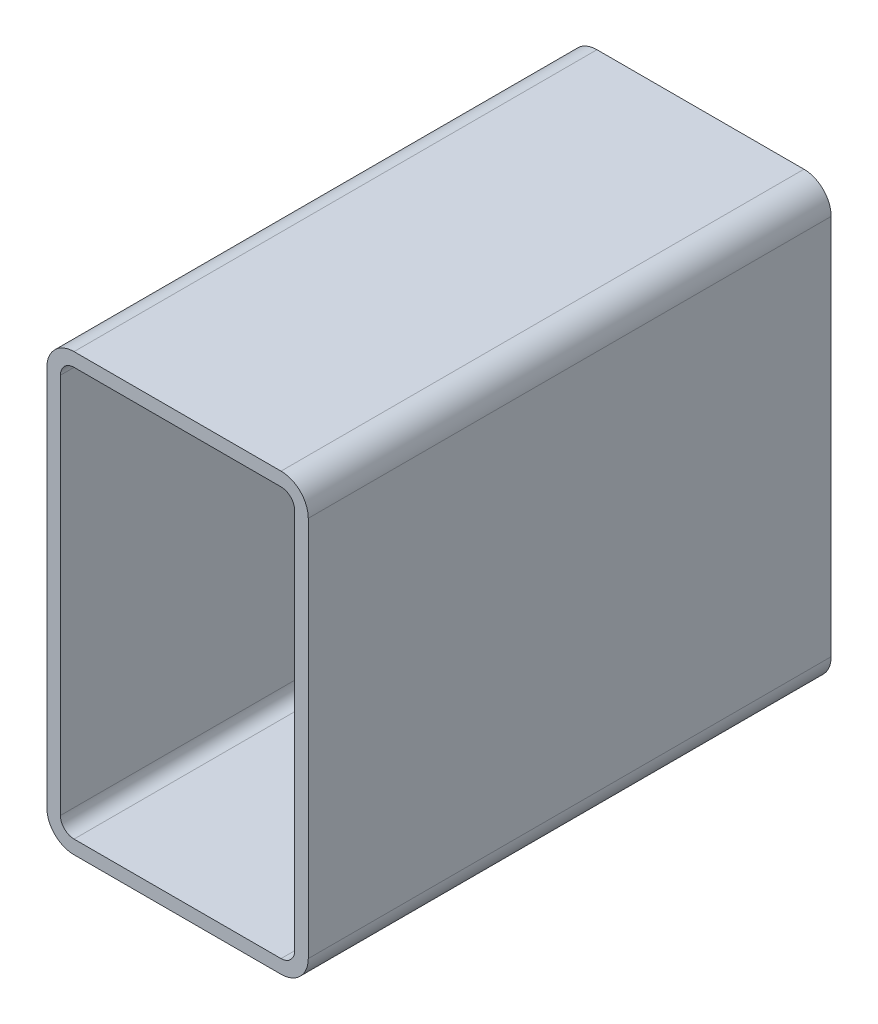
ISO-10303-21;
HEADER;
FILE_DESCRIPTION(('STEP AP214'),'2;1');
FILE_NAME('part.step','',(''),(''),'','','');
FILE_SCHEMA(('AUTOMOTIVE_DESIGN { 1 0 10303 214 1 1 1 1 }'));
ENDSEC;
DATA;
#1=APPLICATION_CONTEXT('core data for automotive mechanical design processes');
#2=APPLICATION_PROTOCOL_DEFINITION('international standard','automotive_design',2000,#1);
#3=PRODUCT_CONTEXT('',#1,'mechanical');
#4=PRODUCT('Part','Part','',(#3));
#5=PRODUCT_RELATED_PRODUCT_CATEGORY('part','',(#4));
#6=PRODUCT_DEFINITION_FORMATION('','',#4);
#7=PRODUCT_DEFINITION_CONTEXT('part definition',#1,'design');
#8=PRODUCT_DEFINITION('design','',#6,#7);
#9=PRODUCT_DEFINITION_SHAPE('','',#8);
#10=(LENGTH_UNIT() NAMED_UNIT(*) SI_UNIT(.MILLI.,.METRE.));
#11=(NAMED_UNIT(*) PLANE_ANGLE_UNIT() SI_UNIT($,.RADIAN.));
#12=(NAMED_UNIT(*) SI_UNIT($,.STERADIAN.) SOLID_ANGLE_UNIT());
#13=UNCERTAINTY_MEASURE_WITH_UNIT(LENGTH_MEASURE(1.E-05),#10,'distance_accuracy_value','');
#14=(GEOMETRIC_REPRESENTATION_CONTEXT(3) GLOBAL_UNCERTAINTY_ASSIGNED_CONTEXT((#13)) GLOBAL_UNIT_ASSIGNED_CONTEXT((#10,
#11,#12)) REPRESENTATION_CONTEXT('',''));
#15=CARTESIAN_POINT('',(0.,0.,0.));
#16=DIRECTION('',(0.,0.,1.));
#17=DIRECTION('',(1.,0.,0.));
#18=AXIS2_PLACEMENT_3D('',#15,#16,#17);
#19=CARTESIAN_POINT('',(15.9223013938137,240.045313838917,304.8));
#20=DIRECTION('',(0.,0.,1.));
#21=DIRECTION('',(1.,0.,0.));
#22=AXIS2_PLACEMENT_3D('',#19,#20,#21);
#23=PLANE('',#22);
#24=CARTESIAN_POINT('',(15.9223013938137,240.045313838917,304.8));
#25=DIRECTION('',(0.,0.,1.));
#26=DIRECTION('',(1.,0.,0.));
#27=AXIS2_PLACEMENT_3D('',#24,#25,#26);
#28=CIRCLE('',#27,15.875);
#29=CARTESIAN_POINT('',(15.9223013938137,255.920313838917,304.8));
#30=VERTEX_POINT('',#29);
#31=CARTESIAN_POINT('',(0.0473013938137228,240.045313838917,304.8));
#32=VERTEX_POINT('',#31);
#33=EDGE_CURVE('E211',#30,#32,#28,.T.);
#34=ORIENTED_EDGE('',*,*,#33,.T.);
#35=DIRECTION('',(0.,-1.,0.));
#36=VECTOR('',#35,1.);
#37=CARTESIAN_POINT('',(0.0473013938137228,17.7953138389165,304.8));
#38=LINE('',#37,#36);
#39=CARTESIAN_POINT('',(0.0473013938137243,17.7953138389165,304.8));
#40=VERTEX_POINT('',#39);
#41=EDGE_CURVE('E214',#32,#40,#38,.T.);
#42=ORIENTED_EDGE('',*,*,#41,.T.);
#43=CARTESIAN_POINT('',(15.9223013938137,17.7953138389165,304.8));
#44=DIRECTION('',(0.,0.,1.));
#45=DIRECTION('',(1.,0.,0.));
#46=AXIS2_PLACEMENT_3D('',#43,#44,#45);
#47=CIRCLE('',#46,15.875);
#48=CARTESIAN_POINT('',(15.9223013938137,1.92031383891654,304.8));
#49=VERTEX_POINT('',#48);
#50=EDGE_CURVE('E217',#40,#49,#47,.T.);
#51=ORIENTED_EDGE('',*,*,#50,.T.);
#52=DIRECTION('',(1.,0.,0.));
#53=VECTOR('',#52,1.);
#54=CARTESIAN_POINT('',(136.572301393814,1.92031383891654,304.8));
#55=LINE('',#54,#53);
#56=CARTESIAN_POINT('',(136.572301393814,1.92031383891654,304.8));
#57=VERTEX_POINT('',#56);
#58=EDGE_CURVE('E219',#49,#57,#55,.T.);
#59=ORIENTED_EDGE('',*,*,#58,.T.);
#60=CARTESIAN_POINT('',(136.572301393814,17.7953138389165,304.8));
#61=DIRECTION('',(0.,0.,1.));
#62=DIRECTION('',(1.,0.,0.));
#63=AXIS2_PLACEMENT_3D('',#60,#61,#62);
#64=CIRCLE('',#63,15.875);
#65=CARTESIAN_POINT('',(152.447301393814,17.7953138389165,304.8));
#66=VERTEX_POINT('',#65);
#67=EDGE_CURVE('E221',#57,#66,#64,.T.);
#68=ORIENTED_EDGE('',*,*,#67,.T.);
#69=DIRECTION('',(0.,1.,0.));
#70=VECTOR('',#69,1.);
#71=CARTESIAN_POINT('',(152.447301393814,240.045313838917,304.8));
#72=LINE('',#71,#70);
#73=CARTESIAN_POINT('',(152.447301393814,240.045313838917,304.8));
#74=VERTEX_POINT('',#73);
#75=EDGE_CURVE('E223',#66,#74,#72,.T.);
#76=ORIENTED_EDGE('',*,*,#75,.T.);
#77=CARTESIAN_POINT('',(136.572301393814,240.045313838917,304.8));
#78=DIRECTION('',(0.,0.,1.));
#79=DIRECTION('',(1.,0.,0.));
#80=AXIS2_PLACEMENT_3D('',#77,#78,#79);
#81=CIRCLE('',#80,15.875);
#82=CARTESIAN_POINT('',(136.572301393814,255.920313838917,304.8));
#83=VERTEX_POINT('',#82);
#84=EDGE_CURVE('E225',#74,#83,#81,.T.);
#85=ORIENTED_EDGE('',*,*,#84,.T.);
#86=DIRECTION('',(-1.,0.,0.));
#87=VECTOR('',#86,1.);
#88=CARTESIAN_POINT('',(15.9223013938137,255.920313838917,304.8));
#89=LINE('',#88,#87);
#90=EDGE_CURVE('E227',#83,#30,#89,.T.);
#91=ORIENTED_EDGE('',*,*,#90,.T.);
#92=EDGE_LOOP('',(#34,#42,#51,#59,#68,#76,#85,#91));
#93=FACE_BOUND('',#92,.T.);
#94=DIRECTION('',(0.,-1.,0.));
#95=VECTOR('',#94,1.);
#96=CARTESIAN_POINT('',(7.98480139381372,17.7953138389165,304.8));
#97=LINE('',#96,#95);
#98=CARTESIAN_POINT('',(7.98480139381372,240.045313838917,304.8));
#99=VERTEX_POINT('',#98);
#100=CARTESIAN_POINT('',(7.98480139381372,17.7953138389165,304.8));
#101=VERTEX_POINT('',#100);
#102=EDGE_CURVE('E154',#99,#101,#97,.T.);
#103=ORIENTED_EDGE('',*,*,#102,.F.);
#104=CARTESIAN_POINT('',(15.9223013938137,240.045313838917,304.8));
#105=DIRECTION('',(0.,0.,1.));
#106=DIRECTION('',(1.,0.,0.));
#107=AXIS2_PLACEMENT_3D('',#104,#105,#106);
#108=CIRCLE('',#107,7.9375);
#109=CARTESIAN_POINT('',(15.9223013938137,247.982813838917,304.8));
#110=VERTEX_POINT('',#109);
#111=EDGE_CURVE('E146',#110,#99,#108,.T.);
#112=ORIENTED_EDGE('',*,*,#111,.F.);
#113=DIRECTION('',(-1.,0.,0.));
#114=VECTOR('',#113,1.);
#115=CARTESIAN_POINT('',(15.9223013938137,247.982813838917,304.8));
#116=LINE('',#115,#114);
#117=CARTESIAN_POINT('',(136.572301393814,247.982813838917,304.8));
#118=VERTEX_POINT('',#117);
#119=EDGE_CURVE('E179',#118,#110,#116,.T.);
#120=ORIENTED_EDGE('',*,*,#119,.F.);
#121=CARTESIAN_POINT('',(136.572301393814,240.045313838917,304.8));
#122=DIRECTION('',(0.,0.,1.));
#123=DIRECTION('',(1.,0.,0.));
#124=AXIS2_PLACEMENT_3D('',#121,#122,#123);
#125=CIRCLE('',#124,7.9375);
#126=CARTESIAN_POINT('',(144.509801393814,240.045313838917,304.8));
#127=VERTEX_POINT('',#126);
#128=EDGE_CURVE('E177',#127,#118,#125,.T.);
#129=ORIENTED_EDGE('',*,*,#128,.F.);
#130=DIRECTION('',(0.,1.,0.));
#131=VECTOR('',#130,1.);
#132=CARTESIAN_POINT('',(144.509801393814,240.045313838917,304.8));
#133=LINE('',#132,#131);
#134=CARTESIAN_POINT('',(144.509801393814,17.7953138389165,304.8));
#135=VERTEX_POINT('',#134);
#136=EDGE_CURVE('E175',#135,#127,#133,.T.);
#137=ORIENTED_EDGE('',*,*,#136,.F.);
#138=CARTESIAN_POINT('',(136.572301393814,17.7953138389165,304.8));
#139=DIRECTION('',(0.,0.,1.));
#140=DIRECTION('',(1.,0.,0.));
#141=AXIS2_PLACEMENT_3D('',#138,#139,#140);
#142=CIRCLE('',#141,7.93750000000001);
#143=CARTESIAN_POINT('',(136.572301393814,9.85781383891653,304.8));
#144=VERTEX_POINT('',#143);
#145=EDGE_CURVE('E173',#144,#135,#142,.T.);
#146=ORIENTED_EDGE('',*,*,#145,.F.);
#147=DIRECTION('',(1.,0.,0.));
#148=VECTOR('',#147,1.);
#149=CARTESIAN_POINT('',(136.572301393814,9.85781383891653,304.8));
#150=LINE('',#149,#148);
#151=CARTESIAN_POINT('',(15.9223013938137,9.85781383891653,304.8));
#152=VERTEX_POINT('',#151);
#153=EDGE_CURVE('E169',#152,#144,#150,.T.);
#154=ORIENTED_EDGE('',*,*,#153,.F.);
#155=CARTESIAN_POINT('',(15.9223013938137,17.7953138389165,304.8));
#156=DIRECTION('',(0.,0.,1.));
#157=DIRECTION('',(1.,0.,0.));
#158=AXIS2_PLACEMENT_3D('',#155,#156,#157);
#159=CIRCLE('',#158,7.9375);
#160=EDGE_CURVE('E167',#101,#152,#159,.T.);
#161=ORIENTED_EDGE('',*,*,#160,.F.);
#162=EDGE_LOOP('',(#103,#112,#120,#129,#137,#146,#154,#161));
#163=FACE_BOUND('',#162,.T.);
#164=ADVANCED_FACE('F33',(#93,#163),#23,.T.);
#165=CARTESIAN_POINT('',(15.9223013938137,240.045313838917,0.));
#166=DIRECTION('',(0.,0.,1.));
#167=DIRECTION('',(1.,0.,0.));
#168=AXIS2_PLACEMENT_3D('',#165,#166,#167);
#169=PLANE('',#168);
#170=CARTESIAN_POINT('',(15.9223013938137,240.045313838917,0.));
#171=DIRECTION('',(0.,0.,1.));
#172=DIRECTION('',(1.,0.,0.));
#173=AXIS2_PLACEMENT_3D('',#170,#171,#172);
#174=CIRCLE('',#173,15.875);
#175=CARTESIAN_POINT('',(15.9223013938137,255.920313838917,0.));
#176=VERTEX_POINT('',#175);
#177=CARTESIAN_POINT('',(0.0473013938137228,240.045313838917,0.));
#178=VERTEX_POINT('',#177);
#179=EDGE_CURVE('E162',#176,#178,#174,.T.);
#180=ORIENTED_EDGE('',*,*,#179,.F.);
#181=DIRECTION('',(-1.,0.,0.));
#182=VECTOR('',#181,1.);
#183=CARTESIAN_POINT('',(15.9223013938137,255.920313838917,0.));
#184=LINE('',#183,#182);
#185=CARTESIAN_POINT('',(136.572301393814,255.920313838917,0.));
#186=VERTEX_POINT('',#185);
#187=EDGE_CURVE('E215',#186,#176,#184,.T.);
#188=ORIENTED_EDGE('',*,*,#187,.F.);
#189=CARTESIAN_POINT('',(136.572301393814,240.045313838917,0.));
#190=DIRECTION('',(0.,0.,1.));
#191=DIRECTION('',(1.,0.,0.));
#192=AXIS2_PLACEMENT_3D('',#189,#190,#191);
#193=CIRCLE('',#192,15.875);
#194=CARTESIAN_POINT('',(152.447301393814,240.045313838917,0.));
#195=VERTEX_POINT('',#194);
#196=EDGE_CURVE('E242',#195,#186,#193,.T.);
#197=ORIENTED_EDGE('',*,*,#196,.F.);
#198=DIRECTION('',(0.,1.,0.));
#199=VECTOR('',#198,1.);
#200=CARTESIAN_POINT('',(152.447301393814,240.045313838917,0.));
#201=LINE('',#200,#199);
#202=CARTESIAN_POINT('',(152.447301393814,17.7953138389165,0.));
#203=VERTEX_POINT('',#202);
#204=EDGE_CURVE('E240',#203,#195,#201,.T.);
#205=ORIENTED_EDGE('',*,*,#204,.F.);
#206=CARTESIAN_POINT('',(136.572301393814,17.7953138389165,0.));
#207=DIRECTION('',(0.,0.,1.));
#208=DIRECTION('',(1.,0.,0.));
#209=AXIS2_PLACEMENT_3D('',#206,#207,#208);
#210=CIRCLE('',#209,15.875);
#211=CARTESIAN_POINT('',(136.572301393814,1.92031383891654,0.));
#212=VERTEX_POINT('',#211);
#213=EDGE_CURVE('E238',#212,#203,#210,.T.);
#214=ORIENTED_EDGE('',*,*,#213,.F.);
#215=DIRECTION('',(1.,0.,0.));
#216=VECTOR('',#215,1.);
#217=CARTESIAN_POINT('',(136.572301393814,1.92031383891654,0.));
#218=LINE('',#217,#216);
#219=CARTESIAN_POINT('',(15.9223013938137,1.92031383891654,0.));
#220=VERTEX_POINT('',#219);
#221=EDGE_CURVE('E236',#220,#212,#218,.T.);
#222=ORIENTED_EDGE('',*,*,#221,.F.);
#223=CARTESIAN_POINT('',(15.9223013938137,17.7953138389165,0.));
#224=DIRECTION('',(0.,0.,1.));
#225=DIRECTION('',(1.,0.,0.));
#226=AXIS2_PLACEMENT_3D('',#223,#224,#225);
#227=CIRCLE('',#226,15.875);
#228=CARTESIAN_POINT('',(0.0473013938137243,17.7953138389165,0.));
#229=VERTEX_POINT('',#228);
#230=EDGE_CURVE('E234',#229,#220,#227,.T.);
#231=ORIENTED_EDGE('',*,*,#230,.F.);
#232=DIRECTION('',(0.,-1.,0.));
#233=VECTOR('',#232,1.);
#234=CARTESIAN_POINT('',(0.0473013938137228,17.7953138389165,0.));
#235=LINE('',#234,#233);
#236=EDGE_CURVE('E232',#178,#229,#235,.T.);
#237=ORIENTED_EDGE('',*,*,#236,.F.);
#238=EDGE_LOOP('',(#180,#188,#197,#205,#214,#222,#231,#237));
#239=FACE_BOUND('',#238,.T.);
#240=CARTESIAN_POINT('',(15.9223013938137,240.045313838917,0.));
#241=DIRECTION('',(0.,0.,1.));
#242=DIRECTION('',(1.,0.,0.));
#243=AXIS2_PLACEMENT_3D('',#240,#241,#242);
#244=CIRCLE('',#243,7.9375);
#245=CARTESIAN_POINT('',(15.9223013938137,247.982813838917,0.));
#246=VERTEX_POINT('',#245);
#247=CARTESIAN_POINT('',(7.98480139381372,240.045313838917,0.));
#248=VERTEX_POINT('',#247);
#249=EDGE_CURVE('E56',#246,#248,#244,.T.);
#250=ORIENTED_EDGE('',*,*,#249,.T.);
#251=DIRECTION('',(0.,-1.,0.));
#252=VECTOR('',#251,1.);
#253=CARTESIAN_POINT('',(7.98480139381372,17.7953138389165,0.));
#254=LINE('',#253,#252);
#255=CARTESIAN_POINT('',(7.98480139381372,17.7953138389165,0.));
#256=VERTEX_POINT('',#255);
#257=EDGE_CURVE('E161',#248,#256,#254,.T.);
#258=ORIENTED_EDGE('',*,*,#257,.T.);
#259=CARTESIAN_POINT('',(15.9223013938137,17.7953138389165,0.));
#260=DIRECTION('',(0.,0.,1.));
#261=DIRECTION('',(1.,0.,0.));
#262=AXIS2_PLACEMENT_3D('',#259,#260,#261);
#263=CIRCLE('',#262,7.9375);
#264=CARTESIAN_POINT('',(15.9223013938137,9.85781383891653,0.));
#265=VERTEX_POINT('',#264);
#266=EDGE_CURVE('E183',#256,#265,#263,.T.);
#267=ORIENTED_EDGE('',*,*,#266,.T.);
#268=DIRECTION('',(1.,0.,0.));
#269=VECTOR('',#268,1.);
#270=CARTESIAN_POINT('',(136.572301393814,9.85781383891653,0.));
#271=LINE('',#270,#269);
#272=CARTESIAN_POINT('',(136.572301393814,9.85781383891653,0.));
#273=VERTEX_POINT('',#272);
#274=EDGE_CURVE('E186',#265,#273,#271,.T.);
#275=ORIENTED_EDGE('',*,*,#274,.T.);
#276=CARTESIAN_POINT('',(136.572301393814,17.7953138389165,0.));
#277=DIRECTION('',(0.,0.,1.));
#278=DIRECTION('',(1.,0.,0.));
#279=AXIS2_PLACEMENT_3D('',#276,#277,#278);
#280=CIRCLE('',#279,7.93750000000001);
#281=CARTESIAN_POINT('',(144.509801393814,17.7953138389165,0.));
#282=VERTEX_POINT('',#281);
#283=EDGE_CURVE('E189',#273,#282,#280,.T.);
#284=ORIENTED_EDGE('',*,*,#283,.T.);
#285=DIRECTION('',(0.,1.,0.));
#286=VECTOR('',#285,1.);
#287=CARTESIAN_POINT('',(144.509801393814,240.045313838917,0.));
#288=LINE('',#287,#286);
#289=CARTESIAN_POINT('',(144.509801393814,240.045313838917,0.));
#290=VERTEX_POINT('',#289);
#291=EDGE_CURVE('E192',#282,#290,#288,.T.);
#292=ORIENTED_EDGE('',*,*,#291,.T.);
#293=CARTESIAN_POINT('',(136.572301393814,240.045313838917,0.));
#294=DIRECTION('',(0.,0.,1.));
#295=DIRECTION('',(1.,0.,0.));
#296=AXIS2_PLACEMENT_3D('',#293,#294,#295);
#297=CIRCLE('',#296,7.9375);
#298=CARTESIAN_POINT('',(136.572301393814,247.982813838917,0.));
#299=VERTEX_POINT('',#298);
#300=EDGE_CURVE('E195',#290,#299,#297,.T.);
#301=ORIENTED_EDGE('',*,*,#300,.T.);
#302=DIRECTION('',(-1.,0.,0.));
#303=VECTOR('',#302,1.);
#304=CARTESIAN_POINT('',(15.9223013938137,247.982813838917,0.));
#305=LINE('',#304,#303);
#306=EDGE_CURVE('E155',#299,#246,#305,.T.);
#307=ORIENTED_EDGE('',*,*,#306,.T.);
#308=EDGE_LOOP('',(#250,#258,#267,#275,#284,#292,#301,#307));
#309=FACE_BOUND('',#308,.T.);
#310=ADVANCED_FACE('F272',(#239,#309),#169,.F.);
#311=CARTESIAN_POINT('',(15.9223013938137,240.045313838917,304.8));
#312=DIRECTION('',(0.,0.,-1.));
#313=DIRECTION('',(-1.,0.,0.));
#314=AXIS2_PLACEMENT_3D('',#311,#312,#313);
#315=CYLINDRICAL_SURFACE('',#314,15.875);
#316=ORIENTED_EDGE('',*,*,#179,.T.);
#317=DIRECTION('',(0.,0.,-1.));
#318=VECTOR('',#317,1.);
#319=CARTESIAN_POINT('',(0.0473013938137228,240.045313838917,304.8));
#320=LINE('',#319,#318);
#321=EDGE_CURVE('E11',#32,#178,#320,.T.);
#322=ORIENTED_EDGE('',*,*,#321,.F.);
#323=ORIENTED_EDGE('',*,*,#33,.F.);
#324=DIRECTION('',(0.,0.,-1.));
#325=VECTOR('',#324,1.);
#326=CARTESIAN_POINT('',(15.9223013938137,255.920313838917,304.8));
#327=LINE('',#326,#325);
#328=EDGE_CURVE('E229',#30,#176,#327,.T.);
#329=ORIENTED_EDGE('',*,*,#328,.T.);
#330=EDGE_LOOP('',(#316,#322,#323,#329));
#331=FACE_BOUND('',#330,.T.);
#332=ADVANCED_FACE('F35',(#331),#315,.T.);
#333=CARTESIAN_POINT('',(0.0473013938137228,17.7953138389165,304.8));
#334=DIRECTION('',(1.,0.,0.));
#335=DIRECTION('',(0.,0.,-1.));
#336=AXIS2_PLACEMENT_3D('',#333,#334,#335);
#337=PLANE('',#336);
#338=ORIENTED_EDGE('',*,*,#236,.T.);
#339=DIRECTION('',(0.,0.,-1.));
#340=VECTOR('',#339,1.);
#341=CARTESIAN_POINT('',(0.0473013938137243,17.7953138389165,304.8));
#342=LINE('',#341,#340);
#343=EDGE_CURVE('E41',#40,#229,#342,.T.);
#344=ORIENTED_EDGE('',*,*,#343,.F.);
#345=ORIENTED_EDGE('',*,*,#41,.F.);
#346=ORIENTED_EDGE('',*,*,#321,.T.);
#347=EDGE_LOOP('',(#338,#344,#345,#346));
#348=FACE_BOUND('',#347,.T.);
#349=ADVANCED_FACE('F289',(#348),#337,.F.);
#350=CARTESIAN_POINT('',(15.9223013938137,17.7953138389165,304.8));
#351=DIRECTION('',(0.,0.,-1.));
#352=DIRECTION('',(-1.,0.,0.));
#353=AXIS2_PLACEMENT_3D('',#350,#351,#352);
#354=CYLINDRICAL_SURFACE('',#353,15.875);
#355=ORIENTED_EDGE('',*,*,#230,.T.);
#356=DIRECTION('',(0.,0.,-1.));
#357=VECTOR('',#356,1.);
#358=CARTESIAN_POINT('',(15.9223013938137,1.92031383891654,304.8));
#359=LINE('',#358,#357);
#360=EDGE_CURVE('E259',#49,#220,#359,.T.);
#361=ORIENTED_EDGE('',*,*,#360,.F.);
#362=ORIENTED_EDGE('',*,*,#50,.F.);
#363=ORIENTED_EDGE('',*,*,#343,.T.);
#364=EDGE_LOOP('',(#355,#361,#362,#363));
#365=FACE_BOUND('',#364,.T.);
#366=ADVANCED_FACE('F266',(#365),#354,.T.);
#367=CARTESIAN_POINT('',(136.572301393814,1.92031383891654,304.8));
#368=DIRECTION('',(0.,1.,0.));
#369=DIRECTION('',(0.,0.,1.));
#370=AXIS2_PLACEMENT_3D('',#367,#368,#369);
#371=PLANE('',#370);
#372=ORIENTED_EDGE('',*,*,#221,.T.);
#373=DIRECTION('',(0.,0.,-1.));
#374=VECTOR('',#373,1.);
#375=CARTESIAN_POINT('',(136.572301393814,1.92031383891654,304.8));
#376=LINE('',#375,#374);
#377=EDGE_CURVE('E256',#57,#212,#376,.T.);
#378=ORIENTED_EDGE('',*,*,#377,.F.);
#379=ORIENTED_EDGE('',*,*,#58,.F.);
#380=ORIENTED_EDGE('',*,*,#360,.T.);
#381=EDGE_LOOP('',(#372,#378,#379,#380));
#382=FACE_BOUND('',#381,.T.);
#383=ADVANCED_FACE('F278',(#382),#371,.F.);
#384=CARTESIAN_POINT('',(136.572301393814,17.7953138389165,304.8));
#385=DIRECTION('',(0.,0.,-1.));
#386=DIRECTION('',(-1.,0.,0.));
#387=AXIS2_PLACEMENT_3D('',#384,#385,#386);
#388=CYLINDRICAL_SURFACE('',#387,15.875);
#389=ORIENTED_EDGE('',*,*,#213,.T.);
#390=DIRECTION('',(0.,0.,-1.));
#391=VECTOR('',#390,1.);
#392=CARTESIAN_POINT('',(152.447301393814,17.7953138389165,304.8));
#393=LINE('',#392,#391);
#394=EDGE_CURVE('E253',#66,#203,#393,.T.);
#395=ORIENTED_EDGE('',*,*,#394,.F.);
#396=ORIENTED_EDGE('',*,*,#67,.F.);
#397=ORIENTED_EDGE('',*,*,#377,.T.);
#398=EDGE_LOOP('',(#389,#395,#396,#397));
#399=FACE_BOUND('',#398,.T.);
#400=ADVANCED_FACE('F282',(#399),#388,.T.);
#401=CARTESIAN_POINT('',(152.447301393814,240.045313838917,304.8));
#402=DIRECTION('',(-1.,0.,0.));
#403=DIRECTION('',(0.,0.,1.));
#404=AXIS2_PLACEMENT_3D('',#401,#402,#403);
#405=PLANE('',#404);
#406=ORIENTED_EDGE('',*,*,#204,.T.);
#407=DIRECTION('',(0.,0.,-1.));
#408=VECTOR('',#407,1.);
#409=CARTESIAN_POINT('',(152.447301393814,240.045313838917,304.8));
#410=LINE('',#409,#408);
#411=EDGE_CURVE('E250',#74,#195,#410,.T.);
#412=ORIENTED_EDGE('',*,*,#411,.F.);
#413=ORIENTED_EDGE('',*,*,#75,.F.);
#414=ORIENTED_EDGE('',*,*,#394,.T.);
#415=EDGE_LOOP('',(#406,#412,#413,#414));
#416=FACE_BOUND('',#415,.T.);
#417=ADVANCED_FACE('F302',(#416),#405,.F.);
#418=CARTESIAN_POINT('',(136.572301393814,240.045313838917,304.8));
#419=DIRECTION('',(0.,0.,-1.));
#420=DIRECTION('',(-1.,0.,0.));
#421=AXIS2_PLACEMENT_3D('',#418,#419,#420);
#422=CYLINDRICAL_SURFACE('',#421,15.875);
#423=ORIENTED_EDGE('',*,*,#196,.T.);
#424=DIRECTION('',(0.,0.,-1.));
#425=VECTOR('',#424,1.);
#426=CARTESIAN_POINT('',(136.572301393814,255.920313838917,304.8));
#427=LINE('',#426,#425);
#428=EDGE_CURVE('E247',#83,#186,#427,.T.);
#429=ORIENTED_EDGE('',*,*,#428,.F.);
#430=ORIENTED_EDGE('',*,*,#84,.F.);
#431=ORIENTED_EDGE('',*,*,#411,.T.);
#432=EDGE_LOOP('',(#423,#429,#430,#431));
#433=FACE_BOUND('',#432,.T.);
#434=ADVANCED_FACE('F300',(#433),#422,.T.);
#435=CARTESIAN_POINT('',(15.9223013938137,255.920313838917,304.8));
#436=DIRECTION('',(0.,-1.,0.));
#437=DIRECTION('',(0.,0.,-1.));
#438=AXIS2_PLACEMENT_3D('',#435,#436,#437);
#439=PLANE('',#438);
#440=ORIENTED_EDGE('',*,*,#187,.T.);
#441=ORIENTED_EDGE('',*,*,#328,.F.);
#442=ORIENTED_EDGE('',*,*,#90,.F.);
#443=ORIENTED_EDGE('',*,*,#428,.T.);
#444=EDGE_LOOP('',(#440,#441,#442,#443));
#445=FACE_BOUND('',#444,.T.);
#446=ADVANCED_FACE('F295',(#445),#439,.F.);
#447=CARTESIAN_POINT('',(15.9223013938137,240.045313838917,304.8));
#448=DIRECTION('',(0.,0.,-1.));
#449=DIRECTION('',(-1.,0.,0.));
#450=AXIS2_PLACEMENT_3D('',#447,#448,#449);
#451=CYLINDRICAL_SURFACE('',#450,7.9375);
#452=ORIENTED_EDGE('',*,*,#249,.F.);
#453=DIRECTION('',(0.,0.,-1.));
#454=VECTOR('',#453,1.);
#455=CARTESIAN_POINT('',(15.9223013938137,247.982813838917,304.8));
#456=LINE('',#455,#454);
#457=EDGE_CURVE('E150',#110,#246,#456,.T.);
#458=ORIENTED_EDGE('',*,*,#457,.F.);
#459=ORIENTED_EDGE('',*,*,#111,.T.);
#460=DIRECTION('',(0.,0.,-1.));
#461=VECTOR('',#460,1.);
#462=CARTESIAN_POINT('',(7.98480139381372,240.045313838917,304.8));
#463=LINE('',#462,#461);
#464=EDGE_CURVE('E149',#99,#248,#463,.T.);
#465=ORIENTED_EDGE('',*,*,#464,.T.);
#466=EDGE_LOOP('',(#452,#458,#459,#465));
#467=FACE_BOUND('',#466,.T.);
#468=ADVANCED_FACE('F148',(#467),#451,.F.);
#469=CARTESIAN_POINT('',(7.98480139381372,17.7953138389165,304.8));
#470=DIRECTION('',(1.,0.,0.));
#471=DIRECTION('',(0.,0.,-1.));
#472=AXIS2_PLACEMENT_3D('',#469,#470,#471);
#473=PLANE('',#472);
#474=ORIENTED_EDGE('',*,*,#257,.F.);
#475=ORIENTED_EDGE('',*,*,#464,.F.);
#476=ORIENTED_EDGE('',*,*,#102,.T.);
#477=DIRECTION('',(0.,0.,-1.));
#478=VECTOR('',#477,1.);
#479=CARTESIAN_POINT('',(7.98480139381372,17.7953138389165,304.8));
#480=LINE('',#479,#478);
#481=EDGE_CURVE('E163',#101,#256,#480,.T.);
#482=ORIENTED_EDGE('',*,*,#481,.T.);
#483=EDGE_LOOP('',(#474,#475,#476,#482));
#484=FACE_BOUND('',#483,.T.);
#485=ADVANCED_FACE('F158',(#484),#473,.T.);
#486=CARTESIAN_POINT('',(15.9223013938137,17.7953138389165,304.8));
#487=DIRECTION('',(0.,0.,-1.));
#488=DIRECTION('',(-1.,0.,0.));
#489=AXIS2_PLACEMENT_3D('',#486,#487,#488);
#490=CYLINDRICAL_SURFACE('',#489,7.9375);
#491=ORIENTED_EDGE('',*,*,#266,.F.);
#492=ORIENTED_EDGE('',*,*,#481,.F.);
#493=ORIENTED_EDGE('',*,*,#160,.T.);
#494=DIRECTION('',(0.,0.,-1.));
#495=VECTOR('',#494,1.);
#496=CARTESIAN_POINT('',(15.9223013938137,9.85781383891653,304.8));
#497=LINE('',#496,#495);
#498=EDGE_CURVE('E208',#152,#265,#497,.T.);
#499=ORIENTED_EDGE('',*,*,#498,.T.);
#500=EDGE_LOOP('',(#491,#492,#493,#499));
#501=FACE_BOUND('',#500,.T.);
#502=ADVANCED_FACE('F327',(#501),#490,.F.);
#503=CARTESIAN_POINT('',(136.572301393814,9.85781383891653,304.8));
#504=DIRECTION('',(0.,1.,0.));
#505=DIRECTION('',(0.,0.,1.));
#506=AXIS2_PLACEMENT_3D('',#503,#504,#505);
#507=PLANE('',#506);
#508=ORIENTED_EDGE('',*,*,#274,.F.);
#509=ORIENTED_EDGE('',*,*,#498,.F.);
#510=ORIENTED_EDGE('',*,*,#153,.T.);
#511=DIRECTION('',(0.,0.,-1.));
#512=VECTOR('',#511,1.);
#513=CARTESIAN_POINT('',(136.572301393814,9.85781383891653,304.8));
#514=LINE('',#513,#512);
#515=EDGE_CURVE('E206',#144,#273,#514,.T.);
#516=ORIENTED_EDGE('',*,*,#515,.T.);
#517=EDGE_LOOP('',(#508,#509,#510,#516));
#518=FACE_BOUND('',#517,.T.);
#519=ADVANCED_FACE('F331',(#518),#507,.T.);
#520=CARTESIAN_POINT('',(136.572301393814,17.7953138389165,304.8));
#521=DIRECTION('',(0.,0.,-1.));
#522=DIRECTION('',(-1.,0.,0.));
#523=AXIS2_PLACEMENT_3D('',#520,#521,#522);
#524=CYLINDRICAL_SURFACE('',#523,7.93750000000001);
#525=ORIENTED_EDGE('',*,*,#283,.F.);
#526=ORIENTED_EDGE('',*,*,#515,.F.);
#527=ORIENTED_EDGE('',*,*,#145,.T.);
#528=DIRECTION('',(0.,0.,-1.));
#529=VECTOR('',#528,1.);
#530=CARTESIAN_POINT('',(144.509801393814,17.7953138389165,304.8));
#531=LINE('',#530,#529);
#532=EDGE_CURVE('E204',#135,#282,#531,.T.);
#533=ORIENTED_EDGE('',*,*,#532,.T.);
#534=EDGE_LOOP('',(#525,#526,#527,#533));
#535=FACE_BOUND('',#534,.T.);
#536=ADVANCED_FACE('F337',(#535),#524,.F.);
#537=CARTESIAN_POINT('',(144.509801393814,240.045313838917,304.8));
#538=DIRECTION('',(-1.,0.,0.));
#539=DIRECTION('',(0.,0.,1.));
#540=AXIS2_PLACEMENT_3D('',#537,#538,#539);
#541=PLANE('',#540);
#542=ORIENTED_EDGE('',*,*,#291,.F.);
#543=ORIENTED_EDGE('',*,*,#532,.F.);
#544=ORIENTED_EDGE('',*,*,#136,.T.);
#545=DIRECTION('',(0.,0.,-1.));
#546=VECTOR('',#545,1.);
#547=CARTESIAN_POINT('',(144.509801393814,240.045313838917,304.8));
#548=LINE('',#547,#546);
#549=EDGE_CURVE('E202',#127,#290,#548,.T.);
#550=ORIENTED_EDGE('',*,*,#549,.T.);
#551=EDGE_LOOP('',(#542,#543,#544,#550));
#552=FACE_BOUND('',#551,.T.);
#553=ADVANCED_FACE('F341',(#552),#541,.T.);
#554=CARTESIAN_POINT('',(136.572301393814,240.045313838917,304.8));
#555=DIRECTION('',(0.,0.,-1.));
#556=DIRECTION('',(-1.,0.,0.));
#557=AXIS2_PLACEMENT_3D('',#554,#555,#556);
#558=CYLINDRICAL_SURFACE('',#557,7.9375);
#559=ORIENTED_EDGE('',*,*,#300,.F.);
#560=ORIENTED_EDGE('',*,*,#549,.F.);
#561=ORIENTED_EDGE('',*,*,#128,.T.);
#562=DIRECTION('',(0.,0.,-1.));
#563=VECTOR('',#562,1.);
#564=CARTESIAN_POINT('',(136.572301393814,247.982813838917,304.8));
#565=LINE('',#564,#563);
#566=EDGE_CURVE('E48',#118,#299,#565,.T.);
#567=ORIENTED_EDGE('',*,*,#566,.T.);
#568=EDGE_LOOP('',(#559,#560,#561,#567));
#569=FACE_BOUND('',#568,.T.);
#570=ADVANCED_FACE('F345',(#569),#558,.F.);
#571=CARTESIAN_POINT('',(15.9223013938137,247.982813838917,304.8));
#572=DIRECTION('',(0.,-1.,0.));
#573=DIRECTION('',(0.,0.,-1.));
#574=AXIS2_PLACEMENT_3D('',#571,#572,#573);
#575=PLANE('',#574);
#576=ORIENTED_EDGE('',*,*,#306,.F.);
#577=ORIENTED_EDGE('',*,*,#566,.F.);
#578=ORIENTED_EDGE('',*,*,#119,.T.);
#579=ORIENTED_EDGE('',*,*,#457,.T.);
#580=EDGE_LOOP('',(#576,#577,#578,#579));
#581=FACE_BOUND('',#580,.T.);
#582=ADVANCED_FACE('F349',(#581),#575,.T.);
#583=CLOSED_SHELL('',(#164,#310,#332,#349,#366,#383,#400,#417,#434,#446,#468,#485,#502,#519,
#536,#553,#570,#582));
#584=MANIFOLD_SOLID_BREP('B2',#583);
#585=ADVANCED_BREP_SHAPE_REPRESENTATION('',(#18,#584),#14);
#586=SHAPE_DEFINITION_REPRESENTATION(#9,#585);
ENDSEC;
END-ISO-10303-21;
